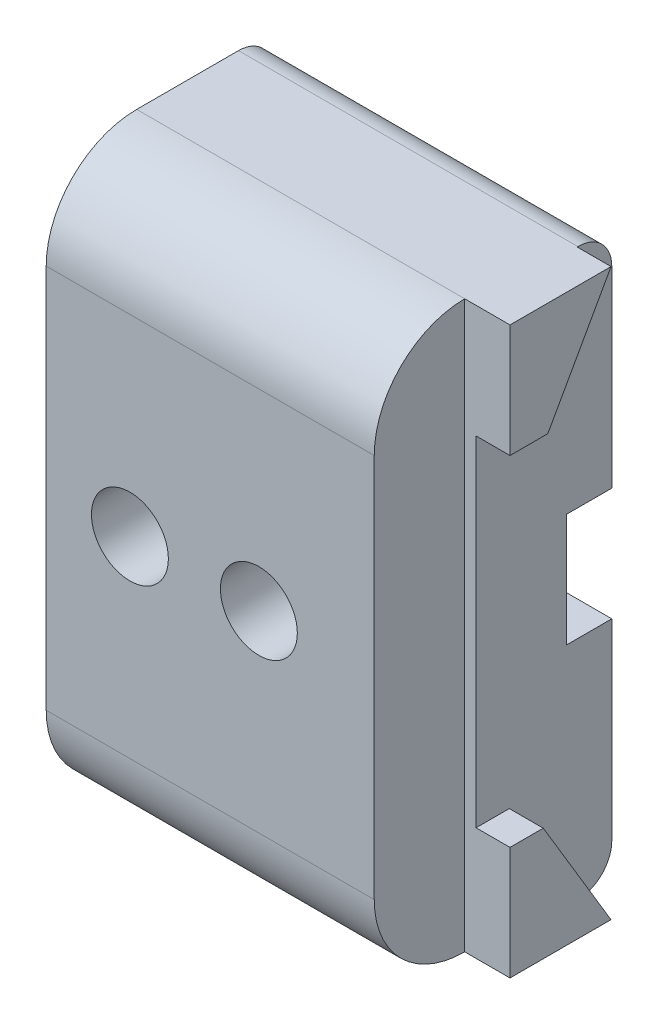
ISO-10303-21;
HEADER;
FILE_DESCRIPTION(('STEP AP214'),'2;1');
FILE_NAME('part.step','',(''),(''),'','','');
FILE_SCHEMA(('AUTOMOTIVE_DESIGN { 1 0 10303 214 1 1 1 1 }'));
ENDSEC;
DATA;
#1=APPLICATION_CONTEXT('core data for automotive mechanical design processes');
#2=APPLICATION_PROTOCOL_DEFINITION('international standard','automotive_design',2000,#1);
#3=PRODUCT_CONTEXT('',#1,'mechanical');
#4=PRODUCT('Part','Part','',(#3));
#5=PRODUCT_RELATED_PRODUCT_CATEGORY('part','',(#4));
#6=PRODUCT_DEFINITION_FORMATION('','',#4);
#7=PRODUCT_DEFINITION_CONTEXT('part definition',#1,'design');
#8=PRODUCT_DEFINITION('design','',#6,#7);
#9=PRODUCT_DEFINITION_SHAPE('','',#8);
#10=(LENGTH_UNIT() NAMED_UNIT(*) SI_UNIT(.MILLI.,.METRE.));
#11=(NAMED_UNIT(*) PLANE_ANGLE_UNIT() SI_UNIT($,.RADIAN.));
#12=(NAMED_UNIT(*) SI_UNIT($,.STERADIAN.) SOLID_ANGLE_UNIT());
#13=UNCERTAINTY_MEASURE_WITH_UNIT(LENGTH_MEASURE(1.E-05),#10,'distance_accuracy_value','');
#14=(GEOMETRIC_REPRESENTATION_CONTEXT(3) GLOBAL_UNCERTAINTY_ASSIGNED_CONTEXT((#13)) GLOBAL_UNIT_ASSIGNED_CONTEXT((#10,
#11,#12)) REPRESENTATION_CONTEXT('',''));
#15=CARTESIAN_POINT('',(0.,0.,0.));
#16=DIRECTION('',(0.,0.,1.));
#17=DIRECTION('',(1.,0.,0.));
#18=AXIS2_PLACEMENT_3D('',#15,#16,#17);
#19=CARTESIAN_POINT('',(61.2558908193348,-12.5,12.));
#20=DIRECTION('',(-1.,0.,0.));
#21=DIRECTION('',(0.,0.,1.));
#22=AXIS2_PLACEMENT_3D('',#19,#20,#21);
#23=PLANE('',#22);
#24=DIRECTION('',(0.,1.,0.));
#25=VECTOR('',#24,1.);
#26=CARTESIAN_POINT('',(61.2558908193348,-12.5,8.));
#27=LINE('',#26,#25);
#28=CARTESIAN_POINT('',(61.2558908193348,7.5,8.));
#29=VERTEX_POINT('',#28);
#30=CARTESIAN_POINT('',(61.2558908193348,12.5,8.));
#31=VERTEX_POINT('',#30);
#32=EDGE_CURVE('E275',#29,#31,#27,.T.);
#33=ORIENTED_EDGE('',*,*,#32,.F.);
#34=DIRECTION('',(0.,0.,1.));
#35=VECTOR('',#34,1.);
#36=CARTESIAN_POINT('',(61.2558908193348,7.5,12.));
#37=LINE('',#36,#35);
#38=CARTESIAN_POINT('',(61.2558908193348,7.5,6.32746314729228));
#39=VERTEX_POINT('',#38);
#40=EDGE_CURVE('E330',#39,#29,#37,.T.);
#41=ORIENTED_EDGE('',*,*,#40,.F.);
#42=DIRECTION('',(0.,-0.87287749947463,0.487939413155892));
#43=VECTOR('',#42,1.);
#44=CARTESIAN_POINT('',(61.2558908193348,6.55895260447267,6.85350960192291));
#45=LINE('',#44,#43);
#46=CARTESIAN_POINT('',(61.2558908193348,12.5,3.53245804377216));
#47=VERTEX_POINT('',#46);
#48=EDGE_CURVE('E280',#47,#39,#45,.T.);
#49=ORIENTED_EDGE('',*,*,#48,.F.);
#50=DIRECTION('',(0.,0.,-1.));
#51=VECTOR('',#50,1.);
#52=CARTESIAN_POINT('',(61.2558908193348,12.5,12.));
#53=LINE('',#52,#51);
#54=EDGE_CURVE('E193',#31,#47,#53,.T.);
#55=ORIENTED_EDGE('',*,*,#54,.F.);
#56=EDGE_LOOP('',(#33,#41,#49,#55));
#57=FACE_BOUND('',#56,.T.);
#58=ADVANCED_FACE('F16',(#57),#23,.F.);
#59=CARTESIAN_POINT('',(61.2558908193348,2.5,0.));
#60=DIRECTION('',(0.,1.,0.));
#61=DIRECTION('',(0.,0.,1.));
#62=AXIS2_PLACEMENT_3D('',#59,#60,#61);
#63=PLANE('',#62);
#64=DIRECTION('',(0.,0.,-1.));
#65=VECTOR('',#64,1.);
#66=CARTESIAN_POINT('',(44.7558908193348,2.5,0.));
#67=LINE('',#66,#65);
#68=CARTESIAN_POINT('',(44.7558908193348,2.5,4.));
#69=VERTEX_POINT('',#68);
#70=CARTESIAN_POINT('',(44.7558908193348,2.5,2.));
#71=VERTEX_POINT('',#70);
#72=EDGE_CURVE('E174',#69,#71,#67,.T.);
#73=ORIENTED_EDGE('',*,*,#72,.T.);
#74=DIRECTION('',(1.,0.,0.));
#75=VECTOR('',#74,1.);
#76=CARTESIAN_POINT('',(61.2558908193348,2.5,2.));
#77=LINE('',#76,#75);
#78=CARTESIAN_POINT('',(59.7558908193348,2.5,2.));
#79=VERTEX_POINT('',#78);
#80=EDGE_CURVE('E165',#71,#79,#77,.T.);
#81=ORIENTED_EDGE('',*,*,#80,.T.);
#82=DIRECTION('',(0.,0.,-1.));
#83=VECTOR('',#82,1.);
#84=CARTESIAN_POINT('',(59.7558908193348,2.5,0.));
#85=LINE('',#84,#83);
#86=CARTESIAN_POINT('',(59.7558908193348,2.5,4.));
#87=VERTEX_POINT('',#86);
#88=EDGE_CURVE('E288',#87,#79,#85,.T.);
#89=ORIENTED_EDGE('',*,*,#88,.F.);
#90=DIRECTION('',(-1.,0.,0.));
#91=VECTOR('',#90,1.);
#92=CARTESIAN_POINT('',(61.2558908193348,2.5,4.));
#93=LINE('',#92,#91);
#94=EDGE_CURVE('E184',#87,#69,#93,.T.);
#95=ORIENTED_EDGE('',*,*,#94,.T.);
#96=EDGE_LOOP('',(#73,#81,#89,#95));
#97=FACE_BOUND('',#96,.T.);
#98=ADVANCED_FACE('F371',(#97),#63,.F.);
#99=CARTESIAN_POINT('',(61.2558908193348,2.5,4.));
#100=DIRECTION('',(0.,0.,1.));
#101=DIRECTION('',(0.,-1.,0.));
#102=AXIS2_PLACEMENT_3D('',#99,#100,#101);
#103=PLANE('',#102);
#104=CARTESIAN_POINT('',(48.4558908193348,0.,4.));
#105=DIRECTION('',(0.,0.,1.));
#106=DIRECTION('',(0.,-1.,0.));
#107=AXIS2_PLACEMENT_3D('',#104,#105,#106);
#108=CIRCLE('',#107,1.7);
#109=CARTESIAN_POINT('',(48.4558908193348,-1.7,4.));
#110=VERTEX_POINT('',#109);
#111=EDGE_CURVE('E346',#110,#110,#108,.T.);
#112=ORIENTED_EDGE('',*,*,#111,.T.);
#113=EDGE_LOOP('',(#112));
#114=FACE_BOUND('',#113,.T.);
#115=CARTESIAN_POINT('',(54.1558908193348,0.,4.));
#116=DIRECTION('',(0.,0.,1.));
#117=DIRECTION('',(0.,-1.,0.));
#118=AXIS2_PLACEMENT_3D('',#115,#116,#117);
#119=CIRCLE('',#118,1.7);
#120=CARTESIAN_POINT('',(54.1558908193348,-1.7,4.));
#121=VERTEX_POINT('',#120);
#122=EDGE_CURVE('E340',#121,#121,#119,.T.);
#123=ORIENTED_EDGE('',*,*,#122,.T.);
#124=EDGE_LOOP('',(#123));
#125=FACE_BOUND('',#124,.T.);
#126=DIRECTION('',(0.,1.,0.));
#127=VECTOR('',#126,1.);
#128=CARTESIAN_POINT('',(59.7558908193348,2.5,4.));
#129=LINE('',#128,#127);
#130=CARTESIAN_POINT('',(59.7558908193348,-2.5,4.));
#131=VERTEX_POINT('',#130);
#132=EDGE_CURVE('E283',#131,#87,#129,.T.);
#133=ORIENTED_EDGE('',*,*,#132,.F.);
#134=DIRECTION('',(-1.,0.,0.));
#135=VECTOR('',#134,1.);
#136=CARTESIAN_POINT('',(61.2558908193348,-2.5,4.));
#137=LINE('',#136,#135);
#138=CARTESIAN_POINT('',(44.7558908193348,-2.5,4.));
#139=VERTEX_POINT('',#138);
#140=EDGE_CURVE('E183',#131,#139,#137,.T.);
#141=ORIENTED_EDGE('',*,*,#140,.T.);
#142=DIRECTION('',(0.,1.,0.));
#143=VECTOR('',#142,1.);
#144=CARTESIAN_POINT('',(44.7558908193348,2.5,4.));
#145=LINE('',#144,#143);
#146=EDGE_CURVE('E171',#139,#69,#145,.T.);
#147=ORIENTED_EDGE('',*,*,#146,.T.);
#148=ORIENTED_EDGE('',*,*,#94,.F.);
#149=EDGE_LOOP('',(#133,#141,#147,#148));
#150=FACE_BOUND('',#149,.T.);
#151=ADVANCED_FACE('F368',(#114,#125,#150),#103,.F.);
#152=CARTESIAN_POINT('',(61.2558908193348,-2.5,0.));
#153=DIRECTION('',(0.,-1.,0.));
#154=DIRECTION('',(0.,0.,-1.));
#155=AXIS2_PLACEMENT_3D('',#152,#153,#154);
#156=PLANE('',#155);
#157=DIRECTION('',(0.,0.,1.));
#158=VECTOR('',#157,1.);
#159=CARTESIAN_POINT('',(59.7558908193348,-2.5,0.));
#160=LINE('',#159,#158);
#161=CARTESIAN_POINT('',(59.7558908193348,-2.5,2.));
#162=VERTEX_POINT('',#161);
#163=EDGE_CURVE('E164',#162,#131,#160,.T.);
#164=ORIENTED_EDGE('',*,*,#163,.F.);
#165=DIRECTION('',(-1.,0.,0.));
#166=VECTOR('',#165,1.);
#167=CARTESIAN_POINT('',(61.2558908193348,-2.5,2.));
#168=LINE('',#167,#166);
#169=CARTESIAN_POINT('',(44.7558908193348,-2.5,2.));
#170=VERTEX_POINT('',#169);
#171=EDGE_CURVE('E150',#162,#170,#168,.T.);
#172=ORIENTED_EDGE('',*,*,#171,.T.);
#173=DIRECTION('',(0.,0.,1.));
#174=VECTOR('',#173,1.);
#175=CARTESIAN_POINT('',(44.7558908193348,-2.5,0.));
#176=LINE('',#175,#174);
#177=EDGE_CURVE('E162',#170,#139,#176,.T.);
#178=ORIENTED_EDGE('',*,*,#177,.T.);
#179=ORIENTED_EDGE('',*,*,#140,.F.);
#180=EDGE_LOOP('',(#164,#172,#178,#179));
#181=FACE_BOUND('',#180,.T.);
#182=ADVANCED_FACE('F160',(#181),#156,.F.);
#183=CARTESIAN_POINT('',(44.7558908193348,-12.5,12.));
#184=DIRECTION('',(1.,0.,0.));
#185=DIRECTION('',(0.,0.,-1.));
#186=AXIS2_PLACEMENT_3D('',#183,#184,#185);
#187=PLANE('',#186);
#188=DIRECTION('',(0.,1.,0.));
#189=VECTOR('',#188,1.);
#190=CARTESIAN_POINT('',(44.7558908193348,12.5,2.));
#191=LINE('',#190,#189);
#192=CARTESIAN_POINT('',(44.7558908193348,-11.,2.));
#193=VERTEX_POINT('',#192);
#194=EDGE_CURVE('E146',#193,#170,#191,.T.);
#195=ORIENTED_EDGE('',*,*,#194,.F.);
#196=CARTESIAN_POINT('',(44.7558908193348,-11.,3.5));
#197=DIRECTION('',(1.,0.,0.));
#198=DIRECTION('',(0.,0.,-1.));
#199=AXIS2_PLACEMENT_3D('',#196,#197,#198);
#200=CIRCLE('',#199,1.5);
#201=CARTESIAN_POINT('',(44.7558908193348,-12.5,3.5));
#202=VERTEX_POINT('',#201);
#203=EDGE_CURVE('E235',#193,#202,#200,.F.);
#204=ORIENTED_EDGE('',*,*,#203,.T.);
#205=DIRECTION('',(0.,0.,-1.));
#206=VECTOR('',#205,1.);
#207=CARTESIAN_POINT('',(44.7558908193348,-12.5,12.));
#208=LINE('',#207,#206);
#209=CARTESIAN_POINT('',(44.7558908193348,-12.5,8.));
#210=VERTEX_POINT('',#209);
#211=EDGE_CURVE('E198',#210,#202,#208,.T.);
#212=ORIENTED_EDGE('',*,*,#211,.F.);
#213=CARTESIAN_POINT('',(44.7558908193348,-8.5,8.));
#214=DIRECTION('',(1.,0.,0.));
#215=DIRECTION('',(0.,0.,-1.));
#216=AXIS2_PLACEMENT_3D('',#213,#214,#215);
#217=CIRCLE('',#216,4.);
#218=CARTESIAN_POINT('',(44.7558908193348,-8.5,12.));
#219=VERTEX_POINT('',#218);
#220=EDGE_CURVE('E225',#210,#219,#217,.F.);
#221=ORIENTED_EDGE('',*,*,#220,.T.);
#222=DIRECTION('',(0.,-1.,0.));
#223=VECTOR('',#222,1.);
#224=CARTESIAN_POINT('',(44.7558908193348,-12.5,12.));
#225=LINE('',#224,#223);
#226=CARTESIAN_POINT('',(44.7558908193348,8.5,12.));
#227=VERTEX_POINT('',#226);
#228=EDGE_CURVE('E186',#227,#219,#225,.T.);
#229=ORIENTED_EDGE('',*,*,#228,.F.);
#230=CARTESIAN_POINT('',(44.7558908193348,8.5,8.));
#231=DIRECTION('',(1.,0.,0.));
#232=DIRECTION('',(0.,0.,-1.));
#233=AXIS2_PLACEMENT_3D('',#230,#231,#232);
#234=CIRCLE('',#233,4.);
#235=CARTESIAN_POINT('',(44.7558908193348,12.5,8.));
#236=VERTEX_POINT('',#235);
#237=EDGE_CURVE('E223',#227,#236,#234,.F.);
#238=ORIENTED_EDGE('',*,*,#237,.T.);
#239=DIRECTION('',(0.,0.,-1.));
#240=VECTOR('',#239,1.);
#241=CARTESIAN_POINT('',(44.7558908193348,12.5,12.));
#242=LINE('',#241,#240);
#243=CARTESIAN_POINT('',(44.7558908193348,12.5,3.5));
#244=VERTEX_POINT('',#243);
#245=EDGE_CURVE('E190',#236,#244,#242,.T.);
#246=ORIENTED_EDGE('',*,*,#245,.T.);
#247=CARTESIAN_POINT('',(44.7558908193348,11.,3.5));
#248=DIRECTION('',(1.,0.,0.));
#249=DIRECTION('',(0.,0.,-1.));
#250=AXIS2_PLACEMENT_3D('',#247,#248,#249);
#251=CIRCLE('',#250,1.5);
#252=CARTESIAN_POINT('',(44.7558908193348,11.,2.));
#253=VERTEX_POINT('',#252);
#254=EDGE_CURVE('E233',#244,#253,#251,.F.);
#255=ORIENTED_EDGE('',*,*,#254,.T.);
#256=EDGE_CURVE('E156',#71,#253,#191,.T.);
#257=ORIENTED_EDGE('',*,*,#256,.F.);
#258=ORIENTED_EDGE('',*,*,#72,.F.);
#259=ORIENTED_EDGE('',*,*,#146,.F.);
#260=ORIENTED_EDGE('',*,*,#177,.F.);
#261=EDGE_LOOP('',(#195,#204,#212,#221,#229,#238,#246,#255,#257,#258,#259,#260));
#262=FACE_BOUND('',#261,.T.);
#263=ADVANCED_FACE('F168',(#262),#187,.F.);
#264=CARTESIAN_POINT('',(44.7558908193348,-12.5,12.));
#265=DIRECTION('',(0.,1.,0.));
#266=DIRECTION('',(0.,0.,1.));
#267=AXIS2_PLACEMENT_3D('',#264,#265,#266);
#268=PLANE('',#267);
#269=ORIENTED_EDGE('',*,*,#211,.T.);
#270=DIRECTION('',(-1.,0.,0.));
#271=VECTOR('',#270,1.);
#272=CARTESIAN_POINT('',(44.7558908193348,-12.5,3.5));
#273=LINE('',#272,#271);
#274=CARTESIAN_POINT('',(59.7558908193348,-12.5,3.5));
#275=VERTEX_POINT('',#274);
#276=EDGE_CURVE('E237',#202,#275,#273,.F.);
#277=ORIENTED_EDGE('',*,*,#276,.T.);
#278=DIRECTION('',(0.,0.,-1.));
#279=VECTOR('',#278,1.);
#280=CARTESIAN_POINT('',(59.7558908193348,-12.5,12.));
#281=LINE('',#280,#279);
#282=CARTESIAN_POINT('',(59.7558908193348,-12.5,3.53481194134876));
#283=VERTEX_POINT('',#282);
#284=EDGE_CURVE('E177',#283,#275,#281,.T.);
#285=ORIENTED_EDGE('',*,*,#284,.F.);
#286=DIRECTION('',(1.,0.,0.));
#287=VECTOR('',#286,1.);
#288=CARTESIAN_POINT('',(44.7558908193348,-12.5,3.53481194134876));
#289=LINE('',#288,#287);
#290=CARTESIAN_POINT('',(61.2558908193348,-12.5,3.53481194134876));
#291=VERTEX_POINT('',#290);
#292=EDGE_CURVE('E172',#283,#291,#289,.T.);
#293=ORIENTED_EDGE('',*,*,#292,.T.);
#294=DIRECTION('',(0.,0.,-1.));
#295=VECTOR('',#294,1.);
#296=CARTESIAN_POINT('',(61.2558908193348,-12.5,12.));
#297=LINE('',#296,#295);
#298=CARTESIAN_POINT('',(61.2558908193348,-12.5,8.));
#299=VERTEX_POINT('',#298);
#300=EDGE_CURVE('E195',#299,#291,#297,.T.);
#301=ORIENTED_EDGE('',*,*,#300,.F.);
#302=DIRECTION('',(-1.,0.,0.));
#303=VECTOR('',#302,1.);
#304=CARTESIAN_POINT('',(61.2558908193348,-12.5,8.));
#305=LINE('',#304,#303);
#306=CARTESIAN_POINT('',(59.2558908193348,-12.5,8.));
#307=VERTEX_POINT('',#306);
#308=EDGE_CURVE('E308',#299,#307,#305,.T.);
#309=ORIENTED_EDGE('',*,*,#308,.T.);
#310=DIRECTION('',(1.,0.,0.));
#311=VECTOR('',#310,1.);
#312=CARTESIAN_POINT('',(44.7558908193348,-12.5,8.));
#313=LINE('',#312,#311);
#314=EDGE_CURVE('E221',#307,#210,#313,.F.);
#315=ORIENTED_EDGE('',*,*,#314,.T.);
#316=EDGE_LOOP('',(#269,#277,#285,#293,#301,#309,#315));
#317=FACE_BOUND('',#316,.T.);
#318=ADVANCED_FACE('F304',(#317),#268,.F.);
#319=DIRECTION('',(0.,-0.857897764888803,-0.513820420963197));
#320=VECTOR('',#319,1.);
#321=CARTESIAN_POINT('',(61.2558908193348,-12.5589526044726,3.49950347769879));
#322=LINE('',#321,#320);
#323=CARTESIAN_POINT('',(61.2558908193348,-7.5,6.5294602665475));
#324=VERTEX_POINT('',#323);
#325=EDGE_CURVE('E265',#324,#291,#322,.T.);
#326=ORIENTED_EDGE('',*,*,#325,.F.);
#327=DIRECTION('',(0.,0.,-1.));
#328=VECTOR('',#327,1.);
#329=CARTESIAN_POINT('',(61.2558908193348,-7.5,12.));
#330=LINE('',#329,#328);
#331=CARTESIAN_POINT('',(61.2558908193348,-7.5,8.));
#332=VERTEX_POINT('',#331);
#333=EDGE_CURVE('E333',#332,#324,#330,.T.);
#334=ORIENTED_EDGE('',*,*,#333,.F.);
#335=EDGE_CURVE('E268',#299,#332,#27,.T.);
#336=ORIENTED_EDGE('',*,*,#335,.F.);
#337=ORIENTED_EDGE('',*,*,#300,.T.);
#338=EDGE_LOOP('',(#326,#334,#336,#337));
#339=FACE_BOUND('',#338,.T.);
#340=ADVANCED_FACE('F388',(#339),#23,.F.);
#341=CARTESIAN_POINT('',(44.7558908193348,12.5,12.));
#342=DIRECTION('',(0.,-1.,0.));
#343=DIRECTION('',(0.,0.,-1.));
#344=AXIS2_PLACEMENT_3D('',#341,#342,#343);
#345=PLANE('',#344);
#346=DIRECTION('',(0.,0.,1.));
#347=VECTOR('',#346,1.);
#348=CARTESIAN_POINT('',(59.7558908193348,12.5,12.));
#349=LINE('',#348,#347);
#350=CARTESIAN_POINT('',(59.7558908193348,12.5,3.5));
#351=VERTEX_POINT('',#350);
#352=CARTESIAN_POINT('',(59.7558908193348,12.5,3.53245804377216));
#353=VERTEX_POINT('',#352);
#354=EDGE_CURVE('E247',#351,#353,#349,.T.);
#355=ORIENTED_EDGE('',*,*,#354,.F.);
#356=DIRECTION('',(-1.,0.,0.));
#357=VECTOR('',#356,1.);
#358=CARTESIAN_POINT('',(44.7558908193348,12.5,3.5));
#359=LINE('',#358,#357);
#360=EDGE_CURVE('E24',#351,#244,#359,.T.);
#361=ORIENTED_EDGE('',*,*,#360,.T.);
#362=ORIENTED_EDGE('',*,*,#245,.F.);
#363=DIRECTION('',(-1.,0.,0.));
#364=VECTOR('',#363,1.);
#365=CARTESIAN_POINT('',(44.7558908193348,12.5,8.));
#366=LINE('',#365,#364);
#367=CARTESIAN_POINT('',(59.2558908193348,12.5,8.));
#368=VERTEX_POINT('',#367);
#369=EDGE_CURVE('E227',#236,#368,#366,.F.);
#370=ORIENTED_EDGE('',*,*,#369,.T.);
#371=DIRECTION('',(-1.,0.,0.));
#372=VECTOR('',#371,1.);
#373=CARTESIAN_POINT('',(61.2558908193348,12.5,8.));
#374=LINE('',#373,#372);
#375=EDGE_CURVE('E271',#31,#368,#374,.T.);
#376=ORIENTED_EDGE('',*,*,#375,.F.);
#377=ORIENTED_EDGE('',*,*,#54,.T.);
#378=DIRECTION('',(-1.,0.,0.));
#379=VECTOR('',#378,1.);
#380=CARTESIAN_POINT('',(44.7558908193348,12.5,3.53245804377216));
#381=LINE('',#380,#379);
#382=EDGE_CURVE('E202',#47,#353,#381,.T.);
#383=ORIENTED_EDGE('',*,*,#382,.T.);
#384=EDGE_LOOP('',(#355,#361,#362,#370,#376,#377,#383));
#385=FACE_BOUND('',#384,.T.);
#386=ADVANCED_FACE('F245',(#385),#345,.F.);
#387=CARTESIAN_POINT('',(0.,0.,12.));
#388=DIRECTION('',(0.,0.,-1.));
#389=DIRECTION('',(-1.,0.,0.));
#390=AXIS2_PLACEMENT_3D('',#387,#388,#389);
#391=PLANE('',#390);
#392=CARTESIAN_POINT('',(48.4558908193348,0.,12.));
#393=DIRECTION('',(0.,0.,1.));
#394=DIRECTION('',(1.,0.,0.));
#395=AXIS2_PLACEMENT_3D('',#392,#393,#394);
#396=CIRCLE('',#395,1.7);
#397=CARTESIAN_POINT('',(50.1558908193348,0.,12.));
#398=VERTEX_POINT('',#397);
#399=EDGE_CURVE('E349',#398,#398,#396,.T.);
#400=ORIENTED_EDGE('',*,*,#399,.F.);
#401=EDGE_LOOP('',(#400));
#402=FACE_BOUND('',#401,.T.);
#403=CARTESIAN_POINT('',(54.1558908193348,0.,12.));
#404=DIRECTION('',(0.,0.,1.));
#405=DIRECTION('',(1.,0.,0.));
#406=AXIS2_PLACEMENT_3D('',#403,#404,#405);
#407=CIRCLE('',#406,1.7);
#408=CARTESIAN_POINT('',(55.8558908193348,0.,12.));
#409=VERTEX_POINT('',#408);
#410=EDGE_CURVE('E343',#409,#409,#407,.T.);
#411=ORIENTED_EDGE('',*,*,#410,.F.);
#412=EDGE_LOOP('',(#411));
#413=FACE_BOUND('',#412,.T.);
#414=ORIENTED_EDGE('',*,*,#228,.T.);
#415=DIRECTION('',(1.,0.,0.));
#416=VECTOR('',#415,1.);
#417=CARTESIAN_POINT('',(0.,-8.5,12.));
#418=LINE('',#417,#416);
#419=CARTESIAN_POINT('',(59.2558908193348,-8.5,12.));
#420=VERTEX_POINT('',#419);
#421=EDGE_CURVE('E214',#219,#420,#418,.T.);
#422=ORIENTED_EDGE('',*,*,#421,.T.);
#423=DIRECTION('',(0.,1.,0.));
#424=VECTOR('',#423,1.);
#425=CARTESIAN_POINT('',(59.2558908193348,-12.5,12.));
#426=LINE('',#425,#424);
#427=CARTESIAN_POINT('',(59.2558908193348,8.5,12.));
#428=VERTEX_POINT('',#427);
#429=EDGE_CURVE('E260',#420,#428,#426,.T.);
#430=ORIENTED_EDGE('',*,*,#429,.T.);
#431=DIRECTION('',(-1.,0.,0.));
#432=VECTOR('',#431,1.);
#433=CARTESIAN_POINT('',(0.,8.5,12.));
#434=LINE('',#433,#432);
#435=EDGE_CURVE('E211',#428,#227,#434,.T.);
#436=ORIENTED_EDGE('',*,*,#435,.T.);
#437=EDGE_LOOP('',(#414,#422,#430,#436));
#438=FACE_BOUND('',#437,.T.);
#439=ADVANCED_FACE('F257',(#402,#413,#438),#391,.F.);
#440=CARTESIAN_POINT('',(59.7558908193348,-12.5589526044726,3.49950347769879));
#441=DIRECTION('',(0.,-0.513820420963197,0.857897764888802));
#442=DIRECTION('',(0.,-0.857897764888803,-0.513820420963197));
#443=AXIS2_PLACEMENT_3D('',#440,#441,#442);
#444=PLANE('',#443);
#445=DIRECTION('',(0.,-0.857897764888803,-0.513820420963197));
#446=VECTOR('',#445,1.);
#447=CARTESIAN_POINT('',(59.7558908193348,-12.5589526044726,3.49950347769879));
#448=LINE('',#447,#446);
#449=CARTESIAN_POINT('',(59.7558908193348,-7.5,6.5294602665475));
#450=VERTEX_POINT('',#449);
#451=EDGE_CURVE('E277',#450,#283,#448,.T.);
#452=ORIENTED_EDGE('',*,*,#451,.F.);
#453=DIRECTION('',(1.,0.,0.));
#454=VECTOR('',#453,1.);
#455=CARTESIAN_POINT('',(59.7558908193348,-7.5,6.52946026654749));
#456=LINE('',#455,#454);
#457=EDGE_CURVE('E322',#450,#324,#456,.T.);
#458=ORIENTED_EDGE('',*,*,#457,.T.);
#459=ORIENTED_EDGE('',*,*,#325,.T.);
#460=ORIENTED_EDGE('',*,*,#292,.F.);
#461=EDGE_LOOP('',(#452,#458,#459,#460));
#462=FACE_BOUND('',#461,.T.);
#463=ADVANCED_FACE('F358',(#462),#444,.F.);
#464=CARTESIAN_POINT('',(59.7558908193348,6.55895260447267,6.85350960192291));
#465=DIRECTION('',(0.,0.487939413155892,0.87287749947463));
#466=DIRECTION('',(0.,-0.872877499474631,0.487939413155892));
#467=AXIS2_PLACEMENT_3D('',#464,#465,#466);
#468=PLANE('',#467);
#469=ORIENTED_EDGE('',*,*,#48,.T.);
#470=DIRECTION('',(-1.,0.,0.));
#471=VECTOR('',#470,1.);
#472=CARTESIAN_POINT('',(59.7558908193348,7.5,6.32746314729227));
#473=LINE('',#472,#471);
#474=CARTESIAN_POINT('',(59.7558908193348,7.5,6.32746314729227));
#475=VERTEX_POINT('',#474);
#476=EDGE_CURVE('E320',#39,#475,#473,.T.);
#477=ORIENTED_EDGE('',*,*,#476,.T.);
#478=DIRECTION('',(0.,-0.87287749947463,0.487939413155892));
#479=VECTOR('',#478,1.);
#480=CARTESIAN_POINT('',(59.7558908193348,6.55895260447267,6.85350960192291));
#481=LINE('',#480,#479);
#482=EDGE_CURVE('E279',#353,#475,#481,.T.);
#483=ORIENTED_EDGE('',*,*,#482,.F.);
#484=ORIENTED_EDGE('',*,*,#382,.F.);
#485=EDGE_LOOP('',(#469,#477,#483,#484));
#486=FACE_BOUND('',#485,.T.);
#487=ADVANCED_FACE('F414',(#486),#468,.F.);
#488=CARTESIAN_POINT('',(59.7558908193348,-0.199999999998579,-5.12058993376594));
#489=DIRECTION('',(1.,0.,0.));
#490=DIRECTION('',(0.,0.,-1.));
#491=AXIS2_PLACEMENT_3D('',#488,#489,#490);
#492=PLANE('',#491);
#493=ORIENTED_EDGE('',*,*,#284,.T.);
#494=CARTESIAN_POINT('',(59.7558908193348,-11.,3.5));
#495=DIRECTION('',(1.,0.,0.));
#496=DIRECTION('',(0.,0.,-1.));
#497=AXIS2_PLACEMENT_3D('',#494,#495,#496);
#498=CIRCLE('',#497,1.5);
#499=CARTESIAN_POINT('',(59.7558908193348,-11.,2.));
#500=VERTEX_POINT('',#499);
#501=EDGE_CURVE('E240',#275,#500,#498,.T.);
#502=ORIENTED_EDGE('',*,*,#501,.T.);
#503=DIRECTION('',(0.,-1.,0.));
#504=VECTOR('',#503,1.);
#505=CARTESIAN_POINT('',(59.7558908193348,-0.199999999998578,2.));
#506=LINE('',#505,#504);
#507=EDGE_CURVE('E229',#162,#500,#506,.T.);
#508=ORIENTED_EDGE('',*,*,#507,.F.);
#509=ORIENTED_EDGE('',*,*,#163,.T.);
#510=ORIENTED_EDGE('',*,*,#132,.T.);
#511=ORIENTED_EDGE('',*,*,#88,.T.);
#512=CARTESIAN_POINT('',(59.7558908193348,11.,2.));
#513=VERTEX_POINT('',#512);
#514=EDGE_CURVE('E231',#513,#79,#506,.T.);
#515=ORIENTED_EDGE('',*,*,#514,.F.);
#516=CARTESIAN_POINT('',(59.7558908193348,11.,3.5));
#517=DIRECTION('',(1.,0.,0.));
#518=DIRECTION('',(0.,0.,-1.));
#519=AXIS2_PLACEMENT_3D('',#516,#517,#518);
#520=CIRCLE('',#519,1.5);
#521=EDGE_CURVE('E31',#513,#351,#520,.T.);
#522=ORIENTED_EDGE('',*,*,#521,.T.);
#523=ORIENTED_EDGE('',*,*,#354,.T.);
#524=ORIENTED_EDGE('',*,*,#482,.T.);
#525=DIRECTION('',(0.,0.,1.));
#526=VECTOR('',#525,1.);
#527=CARTESIAN_POINT('',(59.7558908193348,7.5,12.));
#528=LINE('',#527,#526);
#529=CARTESIAN_POINT('',(59.7558908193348,7.5,8.));
#530=VERTEX_POINT('',#529);
#531=EDGE_CURVE('E327',#475,#530,#528,.T.);
#532=ORIENTED_EDGE('',*,*,#531,.T.);
#533=DIRECTION('',(0.,1.,0.));
#534=VECTOR('',#533,1.);
#535=CARTESIAN_POINT('',(59.7558908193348,-0.199999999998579,8.));
#536=LINE('',#535,#534);
#537=CARTESIAN_POINT('',(59.7558908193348,-7.5,8.));
#538=VERTEX_POINT('',#537);
#539=EDGE_CURVE('E262',#538,#530,#536,.T.);
#540=ORIENTED_EDGE('',*,*,#539,.F.);
#541=DIRECTION('',(0.,0.,-1.));
#542=VECTOR('',#541,1.);
#543=CARTESIAN_POINT('',(59.7558908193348,-7.5,12.));
#544=LINE('',#543,#542);
#545=EDGE_CURVE('E332',#538,#450,#544,.T.);
#546=ORIENTED_EDGE('',*,*,#545,.T.);
#547=ORIENTED_EDGE('',*,*,#451,.T.);
#548=EDGE_LOOP('',(#493,#502,#508,#509,#510,#511,#515,#522,#523,#524,#532,#540,#546,#547));
#549=FACE_BOUND('',#548,.T.);
#550=ADVANCED_FACE('F294',(#549),#492,.T.);
#551=CARTESIAN_POINT('',(61.2558908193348,-12.5,8.));
#552=DIRECTION('',(0.,0.,-1.));
#553=DIRECTION('',(-1.,0.,0.));
#554=AXIS2_PLACEMENT_3D('',#551,#552,#553);
#555=PLANE('',#554);
#556=ORIENTED_EDGE('',*,*,#539,.T.);
#557=DIRECTION('',(1.,0.,0.));
#558=VECTOR('',#557,1.);
#559=CARTESIAN_POINT('',(61.2558908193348,7.5,8.));
#560=LINE('',#559,#558);
#561=EDGE_CURVE('E208',#530,#29,#560,.T.);
#562=ORIENTED_EDGE('',*,*,#561,.T.);
#563=ORIENTED_EDGE('',*,*,#32,.T.);
#564=ORIENTED_EDGE('',*,*,#375,.T.);
#565=DIRECTION('',(0.,1.,0.));
#566=VECTOR('',#565,1.);
#567=CARTESIAN_POINT('',(59.2558908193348,-12.5,8.));
#568=LINE('',#567,#566);
#569=EDGE_CURVE('E263',#307,#368,#568,.T.);
#570=ORIENTED_EDGE('',*,*,#569,.F.);
#571=ORIENTED_EDGE('',*,*,#308,.F.);
#572=ORIENTED_EDGE('',*,*,#335,.T.);
#573=DIRECTION('',(-1.,0.,0.));
#574=VECTOR('',#573,1.);
#575=CARTESIAN_POINT('',(61.2558908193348,-7.5,8.));
#576=LINE('',#575,#574);
#577=EDGE_CURVE('E205',#332,#538,#576,.T.);
#578=ORIENTED_EDGE('',*,*,#577,.T.);
#579=EDGE_LOOP('',(#556,#562,#563,#564,#570,#571,#572,#578));
#580=FACE_BOUND('',#579,.T.);
#581=ADVANCED_FACE('F315',(#580),#555,.F.);
#582=CARTESIAN_POINT('',(59.2558908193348,-12.5,12.));
#583=DIRECTION('',(-1.,0.,0.));
#584=DIRECTION('',(0.,0.,1.));
#585=AXIS2_PLACEMENT_3D('',#582,#583,#584);
#586=PLANE('',#585);
#587=ORIENTED_EDGE('',*,*,#429,.F.);
#588=CARTESIAN_POINT('',(59.2558908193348,-8.5,8.));
#589=DIRECTION('',(-1.,0.,0.));
#590=DIRECTION('',(0.,0.,1.));
#591=AXIS2_PLACEMENT_3D('',#588,#589,#590);
#592=CIRCLE('',#591,4.);
#593=EDGE_CURVE('E219',#420,#307,#592,.F.);
#594=ORIENTED_EDGE('',*,*,#593,.T.);
#595=ORIENTED_EDGE('',*,*,#569,.T.);
#596=CARTESIAN_POINT('',(59.2558908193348,8.5,8.));
#597=DIRECTION('',(-1.,0.,0.));
#598=DIRECTION('',(0.,0.,1.));
#599=AXIS2_PLACEMENT_3D('',#596,#597,#598);
#600=CIRCLE('',#599,4.);
#601=EDGE_CURVE('E217',#368,#428,#600,.F.);
#602=ORIENTED_EDGE('',*,*,#601,.T.);
#603=EDGE_LOOP('',(#587,#594,#595,#602));
#604=FACE_BOUND('',#603,.T.);
#605=ADVANCED_FACE('F312',(#604),#586,.F.);
#606=CARTESIAN_POINT('',(59.7558908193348,-7.5,12.));
#607=DIRECTION('',(0.,-1.,0.));
#608=DIRECTION('',(0.,0.,-1.));
#609=AXIS2_PLACEMENT_3D('',#606,#607,#608);
#610=PLANE('',#609);
#611=ORIENTED_EDGE('',*,*,#545,.F.);
#612=ORIENTED_EDGE('',*,*,#577,.F.);
#613=ORIENTED_EDGE('',*,*,#333,.T.);
#614=ORIENTED_EDGE('',*,*,#457,.F.);
#615=EDGE_LOOP('',(#611,#612,#613,#614));
#616=FACE_BOUND('',#615,.T.);
#617=ADVANCED_FACE('F408',(#616),#610,.F.);
#618=CARTESIAN_POINT('',(59.7558908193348,7.5,12.));
#619=DIRECTION('',(0.,1.,0.));
#620=DIRECTION('',(0.,0.,1.));
#621=AXIS2_PLACEMENT_3D('',#618,#619,#620);
#622=PLANE('',#621);
#623=ORIENTED_EDGE('',*,*,#40,.T.);
#624=ORIENTED_EDGE('',*,*,#561,.F.);
#625=ORIENTED_EDGE('',*,*,#531,.F.);
#626=ORIENTED_EDGE('',*,*,#476,.F.);
#627=EDGE_LOOP('',(#623,#624,#625,#626));
#628=FACE_BOUND('',#627,.T.);
#629=ADVANCED_FACE('F438',(#628),#622,.F.);
#630=CARTESIAN_POINT('',(0.,-8.5,8.));
#631=DIRECTION('',(1.,0.,0.));
#632=DIRECTION('',(0.,0.,-1.));
#633=AXIS2_PLACEMENT_3D('',#630,#631,#632);
#634=CYLINDRICAL_SURFACE('',#633,4.);
#635=ORIENTED_EDGE('',*,*,#220,.F.);
#636=ORIENTED_EDGE('',*,*,#314,.F.);
#637=ORIENTED_EDGE('',*,*,#593,.F.);
#638=ORIENTED_EDGE('',*,*,#421,.F.);
#639=EDGE_LOOP('',(#635,#636,#637,#638));
#640=FACE_BOUND('',#639,.T.);
#641=ADVANCED_FACE('F310',(#640),#634,.T.);
#642=CARTESIAN_POINT('',(0.,8.5,8.));
#643=DIRECTION('',(-1.,0.,0.));
#644=DIRECTION('',(0.,0.,1.));
#645=AXIS2_PLACEMENT_3D('',#642,#643,#644);
#646=CYLINDRICAL_SURFACE('',#645,4.);
#647=ORIENTED_EDGE('',*,*,#601,.F.);
#648=ORIENTED_EDGE('',*,*,#369,.F.);
#649=ORIENTED_EDGE('',*,*,#237,.F.);
#650=ORIENTED_EDGE('',*,*,#435,.F.);
#651=EDGE_LOOP('',(#647,#648,#649,#650));
#652=FACE_BOUND('',#651,.T.);
#653=ADVANCED_FACE('F254',(#652),#646,.T.);
#654=CARTESIAN_POINT('',(61.2558908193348,12.5,2.));
#655=DIRECTION('',(0.,0.,1.));
#656=DIRECTION('',(0.,-1.,0.));
#657=AXIS2_PLACEMENT_3D('',#654,#655,#656);
#658=PLANE('',#657);
#659=ORIENTED_EDGE('',*,*,#507,.T.);
#660=DIRECTION('',(-1.,0.,0.));
#661=VECTOR('',#660,1.);
#662=CARTESIAN_POINT('',(61.2558908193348,-11.,2.));
#663=LINE('',#662,#661);
#664=EDGE_CURVE('E153',#500,#193,#663,.T.);
#665=ORIENTED_EDGE('',*,*,#664,.T.);
#666=ORIENTED_EDGE('',*,*,#194,.T.);
#667=ORIENTED_EDGE('',*,*,#171,.F.);
#668=EDGE_LOOP('',(#659,#665,#666,#667));
#669=FACE_BOUND('',#668,.T.);
#670=ADVANCED_FACE('F149',(#669),#658,.F.);
#671=ORIENTED_EDGE('',*,*,#256,.T.);
#672=DIRECTION('',(-1.,0.,0.));
#673=VECTOR('',#672,1.);
#674=CARTESIAN_POINT('',(61.2558908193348,11.,2.));
#675=LINE('',#674,#673);
#676=EDGE_CURVE('E11',#253,#513,#675,.F.);
#677=ORIENTED_EDGE('',*,*,#676,.T.);
#678=ORIENTED_EDGE('',*,*,#514,.T.);
#679=ORIENTED_EDGE('',*,*,#80,.F.);
#680=EDGE_LOOP('',(#671,#677,#678,#679));
#681=FACE_BOUND('',#680,.T.);
#682=ADVANCED_FACE('F378',(#681),#658,.F.);
#683=CARTESIAN_POINT('',(61.2558908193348,-11.,3.5));
#684=DIRECTION('',(-1.,0.,0.));
#685=DIRECTION('',(0.,0.,1.));
#686=AXIS2_PLACEMENT_3D('',#683,#684,#685);
#687=CYLINDRICAL_SURFACE('',#686,1.5);
#688=ORIENTED_EDGE('',*,*,#501,.F.);
#689=ORIENTED_EDGE('',*,*,#276,.F.);
#690=ORIENTED_EDGE('',*,*,#203,.F.);
#691=ORIENTED_EDGE('',*,*,#664,.F.);
#692=EDGE_LOOP('',(#688,#689,#690,#691));
#693=FACE_BOUND('',#692,.T.);
#694=ADVANCED_FACE('F301',(#693),#687,.T.);
#695=CARTESIAN_POINT('',(44.7558908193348,11.,3.5));
#696=DIRECTION('',(-1.,0.,0.));
#697=DIRECTION('',(0.,0.,1.));
#698=AXIS2_PLACEMENT_3D('',#695,#696,#697);
#699=CYLINDRICAL_SURFACE('',#698,1.5);
#700=ORIENTED_EDGE('',*,*,#521,.F.);
#701=ORIENTED_EDGE('',*,*,#676,.F.);
#702=ORIENTED_EDGE('',*,*,#254,.F.);
#703=ORIENTED_EDGE('',*,*,#360,.F.);
#704=EDGE_LOOP('',(#700,#701,#702,#703));
#705=FACE_BOUND('',#704,.T.);
#706=ADVANCED_FACE('F18',(#705),#699,.T.);
#707=CARTESIAN_POINT('',(54.1558908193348,0.,12.));
#708=DIRECTION('',(0.,0.,1.));
#709=DIRECTION('',(1.,0.,0.));
#710=AXIS2_PLACEMENT_3D('',#707,#708,#709);
#711=CYLINDRICAL_SURFACE('',#710,1.7);
#712=ORIENTED_EDGE('',*,*,#410,.T.);
#713=EDGE_LOOP('',(#712));
#714=FACE_BOUND('',#713,.T.);
#715=ORIENTED_EDGE('',*,*,#122,.F.);
#716=EDGE_LOOP('',(#715));
#717=FACE_BOUND('',#716,.T.);
#718=ADVANCED_FACE('F362',(#714,#717),#711,.F.);
#719=CARTESIAN_POINT('',(48.4558908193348,0.,12.));
#720=DIRECTION('',(0.,0.,1.));
#721=DIRECTION('',(1.,0.,0.));
#722=AXIS2_PLACEMENT_3D('',#719,#720,#721);
#723=CYLINDRICAL_SURFACE('',#722,1.7);
#724=ORIENTED_EDGE('',*,*,#399,.T.);
#725=EDGE_LOOP('',(#724));
#726=FACE_BOUND('',#725,.T.);
#727=ORIENTED_EDGE('',*,*,#111,.F.);
#728=EDGE_LOOP('',(#727));
#729=FACE_BOUND('',#728,.T.);
#730=ADVANCED_FACE('F353',(#726,#729),#723,.F.);
#731=CLOSED_SHELL('',(#58,#98,#151,#182,#263,#318,#340,#386,#439,#463,#487,#550,#581,#605,#617,
#629,#641,#653,#670,#682,#694,#706,#718,#730));
#732=MANIFOLD_SOLID_BREP('B1',#731);
#733=ADVANCED_BREP_SHAPE_REPRESENTATION('',(#18,#732),#14);
#734=SHAPE_DEFINITION_REPRESENTATION(#9,#733);
ENDSEC;
END-ISO-10303-21;
